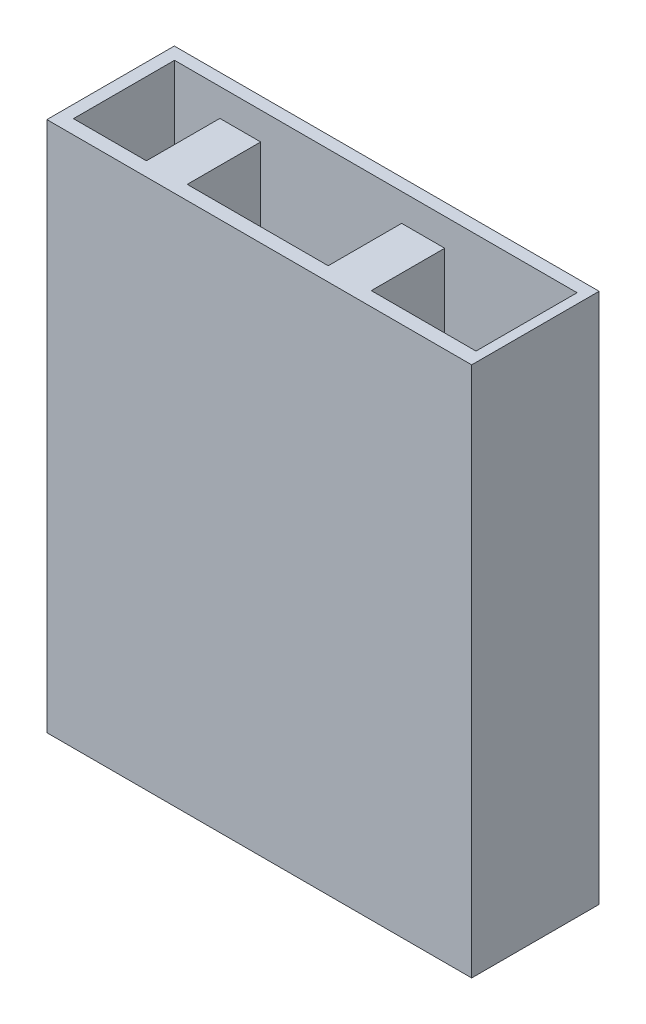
from build123d import *

# Parameters (mm, degrees)
SKETCH1_W           = 4
SKETCH1_H           = 1.2
BOSS_EXTRUDE1_DEPTH = 5
CUT_EXTRUDE1_DEPTH  = 7.51459899


with BuildPart() as part:
    # Sketch1 → Boss-Extrude1 (new body)
    with BuildSketch(Plane(origin=(0, 0, 0), x_dir=(1, 0, 0), z_dir=(0, 1, 0))):
        with Locations((2, -0.6)):
            Rectangle(SKETCH1_W, SKETCH1_H)
    extrude(amount=BOSS_EXTRUDE1_DEPTH)

    # Sketch2 → Cut-Extrude1 (cut, through all)
    with BuildSketch(Plane(origin=(0, 5, 0), x_dir=(1, 0, 0), z_dir=(0, 1, 0))):
        Polygon((1.188967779, -1.067410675), (2.516499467, -1.067410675), (2.516499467, -0.375898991), (2.922015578, -0.375898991), (2.922015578, -1.067410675), (3.908060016, -1.067410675), (3.908060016, -0.115514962), (0.117551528, -0.115514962), (0.117551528, -1.067410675), (0.804794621, -1.067410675), (0.804794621, -0.375898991), (1.188967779, -0.375898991), align=None)
    extrude(amount=-CUT_EXTRUDE1_DEPTH, mode=Mode.SUBTRACT)


solid = part.part
